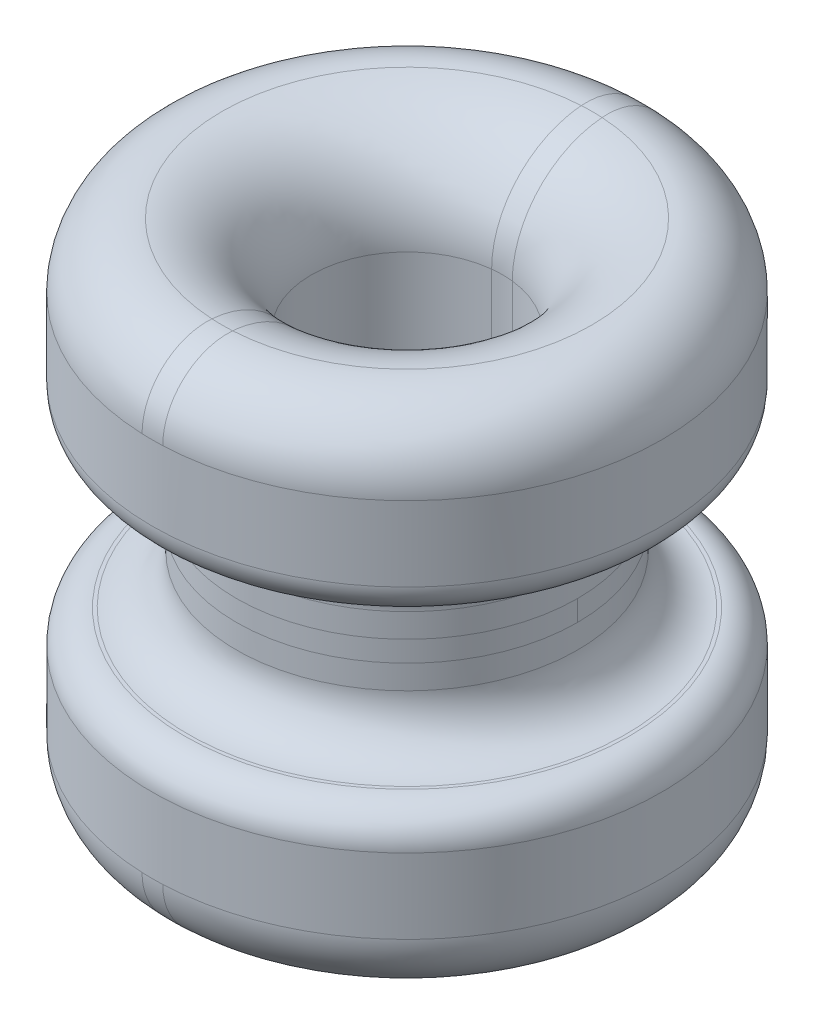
from build123d import *

# Parameters (mm, degrees)
FILLET1_R = 7.62
FILLET2_R = 5.08
FILLET3_R = 2.54
FILLET4_R = 3.81


with BuildPart() as part:
    # Sketch1 → Revolve1 (revolve)
    with BuildSketch(Plane.XY, mode=Mode.PRIVATE) as revolve1_sk:
        Polygon((-7.5, -20), (-7.5, 20), (-20, 20), (-20, 6.5), (-13.385620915, 6.5), (-13.385620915, -6.5), (-20, -6.5), (-20, -20), align=None)
    revolve(revolve1_sk.sketch.rotate(Axis((0, -20, 0), (0, 1, 0)), 270), axis=Axis((0, -20, 0), (0, 1, 0)))

    # Fillet1
    fillet1_edges = [part.edges().sort_by_distance(p)[0] for p in [
        (0, 20, 7.5),
        (0, -20, 7.5),
    ]]
    fillet(fillet1_edges, radius=FILLET1_R)

    # Fillet2
    fillet2_edges = [part.edges().sort_by_distance(p)[0] for p in [
        (0, 20, 20),
        (0, -20, 20),
    ]]
    fillet(fillet2_edges, radius=FILLET2_R)

    # Fillet3
    fillet3_edges = [part.edges().sort_by_distance(p)[0] for p in [
        (0, 6.5, 20),
        (0, -6.5, 20),
    ]]
    fillet(fillet3_edges, radius=FILLET3_R)

    # Fillet4
    fillet4_edges = [part.edges().sort_by_distance(p)[0] for p in [
        (0, -6.5, 13.385620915),
        (0, 6.5, 13.385620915),
    ]]
    fillet(fillet4_edges, radius=FILLET4_R)


solid = part.part
